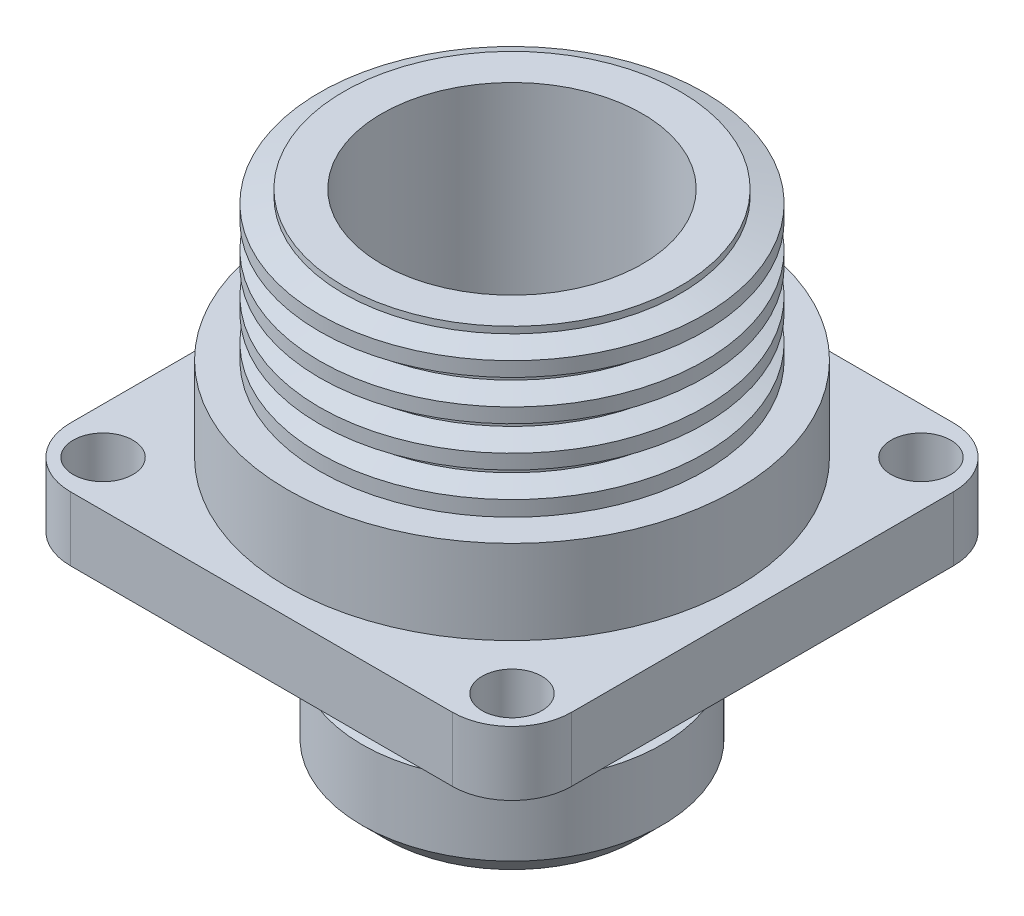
ISO-10303-21;
HEADER;
FILE_DESCRIPTION(('STEP AP214'),'2;1');
FILE_NAME('part.step','',(''),(''),'','','');
FILE_SCHEMA(('AUTOMOTIVE_DESIGN { 1 0 10303 214 1 1 1 1 }'));
ENDSEC;
DATA;
#1=APPLICATION_CONTEXT('core data for automotive mechanical design processes');
#2=APPLICATION_PROTOCOL_DEFINITION('international standard','automotive_design',2000,#1);
#3=PRODUCT_CONTEXT('',#1,'mechanical');
#4=PRODUCT('Part','Part','',(#3));
#5=PRODUCT_RELATED_PRODUCT_CATEGORY('part','',(#4));
#6=PRODUCT_DEFINITION_FORMATION('','',#4);
#7=PRODUCT_DEFINITION_CONTEXT('part definition',#1,'design');
#8=PRODUCT_DEFINITION('design','',#6,#7);
#9=PRODUCT_DEFINITION_SHAPE('','',#8);
#10=(LENGTH_UNIT() NAMED_UNIT(*) SI_UNIT(.MILLI.,.METRE.));
#11=(NAMED_UNIT(*) PLANE_ANGLE_UNIT() SI_UNIT($,.RADIAN.));
#12=(NAMED_UNIT(*) SI_UNIT($,.STERADIAN.) SOLID_ANGLE_UNIT());
#13=UNCERTAINTY_MEASURE_WITH_UNIT(LENGTH_MEASURE(1.E-05),#10,'distance_accuracy_value','');
#14=(GEOMETRIC_REPRESENTATION_CONTEXT(3) GLOBAL_UNCERTAINTY_ASSIGNED_CONTEXT((#13)) GLOBAL_UNIT_ASSIGNED_CONTEXT((#10,
#11,#12)) REPRESENTATION_CONTEXT('',''));
#15=CARTESIAN_POINT('',(0.,0.,0.));
#16=DIRECTION('',(0.,0.,1.));
#17=DIRECTION('',(1.,0.,0.));
#18=AXIS2_PLACEMENT_3D('',#15,#16,#17);
#19=CARTESIAN_POINT('',(0.,18.796,0.));
#20=DIRECTION('',(0.,-1.,0.));
#21=DIRECTION('',(0.,0.,-1.));
#22=AXIS2_PLACEMENT_3D('',#19,#20,#21);
#23=CYLINDRICAL_SURFACE('',#22,12.192);
#24=CARTESIAN_POINT('',(0.,10.3669138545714,0.));
#25=DIRECTION('',(0.,-1.,0.));
#26=DIRECTION('',(0.,0.,-1.));
#27=AXIS2_PLACEMENT_3D('',#24,#25,#26);
#28=CIRCLE('',#27,12.1920000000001);
#29=CARTESIAN_POINT('',(0.,10.3669138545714,-12.1920000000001));
#30=VERTEX_POINT('',#29);
#31=EDGE_CURVE('E536',#30,#30,#28,.T.);
#32=ORIENTED_EDGE('',*,*,#31,.T.);
#33=EDGE_LOOP('',(#32));
#34=FACE_BOUND('',#33,.T.);
#35=CARTESIAN_POINT('',(0.,9.398,0.));
#36=DIRECTION('',(0.,1.,0.));
#37=DIRECTION('',(0.,0.,1.));
#38=AXIS2_PLACEMENT_3D('',#35,#36,#37);
#39=CIRCLE('',#38,12.192);
#40=CARTESIAN_POINT('',(0.,9.398,12.192));
#41=VERTEX_POINT('',#40);
#42=EDGE_CURVE('E541',#41,#41,#39,.T.);
#43=ORIENTED_EDGE('',*,*,#42,.T.);
#44=EDGE_LOOP('',(#43));
#45=FACE_BOUND('',#44,.T.);
#46=ADVANCED_FACE('F258',(#34,#45),#23,.T.);
#47=CARTESIAN_POINT('',(0.,9.398,0.));
#48=DIRECTION('',(0.,1.,0.));
#49=DIRECTION('',(0.,0.,1.));
#50=AXIS2_PLACEMENT_3D('',#47,#48,#49);
#51=PLANE('',#50);
#52=CARTESIAN_POINT('',(0.,9.398,0.));
#53=DIRECTION('',(0.,1.,0.));
#54=DIRECTION('',(0.,0.,1.));
#55=AXIS2_PLACEMENT_3D('',#52,#53,#54);
#56=CIRCLE('',#55,14.224);
#57=CARTESIAN_POINT('',(0.,9.398,14.224));
#58=VERTEX_POINT('',#57);
#59=EDGE_CURVE('E545',#58,#58,#56,.T.);
#60=ORIENTED_EDGE('',*,*,#59,.T.);
#61=EDGE_LOOP('',(#60));
#62=FACE_BOUND('',#61,.T.);
#63=ORIENTED_EDGE('',*,*,#42,.F.);
#64=EDGE_LOOP('',(#63));
#65=FACE_BOUND('',#64,.T.);
#66=ADVANCED_FACE('F456',(#62,#65),#51,.T.);
#67=CARTESIAN_POINT('',(-15.875,4.064,15.875));
#68=DIRECTION('',(0.,1.,0.));
#69=DIRECTION('',(0.,0.,1.));
#70=AXIS2_PLACEMENT_3D('',#67,#68,#69);
#71=PLANE('',#70);
#72=CARTESIAN_POINT('',(-12.954,4.064,12.954));
#73=DIRECTION('',(0.,1.,0.));
#74=DIRECTION('',(0.,0.,-1.));
#75=AXIS2_PLACEMENT_3D('',#72,#73,#74);
#76=CIRCLE('',#75,1.8923);
#77=CARTESIAN_POINT('',(-12.954,4.064,11.0617));
#78=VERTEX_POINT('',#77);
#79=EDGE_CURVE('E401',#78,#78,#76,.T.);
#80=ORIENTED_EDGE('',*,*,#79,.F.);
#81=EDGE_LOOP('',(#80));
#82=FACE_BOUND('',#81,.T.);
#83=CARTESIAN_POINT('',(12.954,4.064,-12.954));
#84=DIRECTION('',(0.,1.,0.));
#85=DIRECTION('',(0.,0.,-1.));
#86=AXIS2_PLACEMENT_3D('',#83,#84,#85);
#87=CIRCLE('',#86,1.8923);
#88=CARTESIAN_POINT('',(12.954,4.064,-14.8463));
#89=VERTEX_POINT('',#88);
#90=EDGE_CURVE('E416',#89,#89,#87,.T.);
#91=ORIENTED_EDGE('',*,*,#90,.F.);
#92=EDGE_LOOP('',(#91));
#93=FACE_BOUND('',#92,.T.);
#94=DIRECTION('',(0.,0.,-1.));
#95=VECTOR('',#94,1.);
#96=CARTESIAN_POINT('',(15.875,4.064,-15.875));
#97=LINE('',#96,#95);
#98=CARTESIAN_POINT('',(15.875,4.064,12.0904));
#99=VERTEX_POINT('',#98);
#100=CARTESIAN_POINT('',(15.875,4.064,-12.0904));
#101=VERTEX_POINT('',#100);
#102=EDGE_CURVE('E429',#99,#101,#97,.T.);
#103=ORIENTED_EDGE('',*,*,#102,.T.);
#104=CARTESIAN_POINT('',(12.0904,4.064,-12.0904));
#105=DIRECTION('',(0.,1.,0.));
#106=DIRECTION('',(0.,0.,1.));
#107=AXIS2_PLACEMENT_3D('',#104,#105,#106);
#108=CIRCLE('',#107,3.7846);
#109=CARTESIAN_POINT('',(12.0904,4.064,-15.875));
#110=VERTEX_POINT('',#109);
#111=EDGE_CURVE('E384',#101,#110,#108,.T.);
#112=ORIENTED_EDGE('',*,*,#111,.T.);
#113=DIRECTION('',(-1.,0.,0.));
#114=VECTOR('',#113,1.);
#115=CARTESIAN_POINT('',(-15.875,4.064,-15.875));
#116=LINE('',#115,#114);
#117=CARTESIAN_POINT('',(-12.0904,4.064,-15.875));
#118=VERTEX_POINT('',#117);
#119=EDGE_CURVE('E346',#110,#118,#116,.T.);
#120=ORIENTED_EDGE('',*,*,#119,.T.);
#121=CARTESIAN_POINT('',(-12.0904,4.064,-12.0904));
#122=DIRECTION('',(0.,1.,0.));
#123=DIRECTION('',(0.,0.,1.));
#124=AXIS2_PLACEMENT_3D('',#121,#122,#123);
#125=CIRCLE('',#124,3.7846);
#126=CARTESIAN_POINT('',(-15.875,4.064,-12.0904));
#127=VERTEX_POINT('',#126);
#128=EDGE_CURVE('E382',#118,#127,#125,.T.);
#129=ORIENTED_EDGE('',*,*,#128,.T.);
#130=DIRECTION('',(0.,0.,1.));
#131=VECTOR('',#130,1.);
#132=CARTESIAN_POINT('',(-15.875,4.064,-15.875));
#133=LINE('',#132,#131);
#134=CARTESIAN_POINT('',(-15.875,4.064,12.0904));
#135=VERTEX_POINT('',#134);
#136=EDGE_CURVE('E353',#127,#135,#133,.T.);
#137=ORIENTED_EDGE('',*,*,#136,.T.);
#138=CARTESIAN_POINT('',(-12.0904,4.064,12.0904));
#139=DIRECTION('',(0.,1.,0.));
#140=DIRECTION('',(0.,0.,1.));
#141=AXIS2_PLACEMENT_3D('',#138,#139,#140);
#142=CIRCLE('',#141,3.7846);
#143=CARTESIAN_POINT('',(-12.0904,4.064,15.875));
#144=VERTEX_POINT('',#143);
#145=EDGE_CURVE('E281',#135,#144,#142,.T.);
#146=ORIENTED_EDGE('',*,*,#145,.T.);
#147=DIRECTION('',(1.,0.,0.));
#148=VECTOR('',#147,1.);
#149=CARTESIAN_POINT('',(-15.875,4.064,15.875));
#150=LINE('',#149,#148);
#151=CARTESIAN_POINT('',(12.0904,4.064,15.875));
#152=VERTEX_POINT('',#151);
#153=EDGE_CURVE('E356',#144,#152,#150,.T.);
#154=ORIENTED_EDGE('',*,*,#153,.T.);
#155=CARTESIAN_POINT('',(12.0904,4.064,12.0904));
#156=DIRECTION('',(0.,1.,0.));
#157=DIRECTION('',(0.,0.,1.));
#158=AXIS2_PLACEMENT_3D('',#155,#156,#157);
#159=CIRCLE('',#158,3.7846);
#160=EDGE_CURVE('E379',#152,#99,#159,.T.);
#161=ORIENTED_EDGE('',*,*,#160,.T.);
#162=EDGE_LOOP('',(#103,#112,#120,#129,#137,#146,#154,#161));
#163=FACE_BOUND('',#162,.T.);
#164=CARTESIAN_POINT('',(-12.954,4.064,-12.954));
#165=DIRECTION('',(0.,1.,0.));
#166=DIRECTION('',(0.,0.,1.));
#167=AXIS2_PLACEMENT_3D('',#164,#165,#166);
#168=CIRCLE('',#167,1.8923);
#169=CARTESIAN_POINT('',(-12.954,4.064,-11.0617));
#170=VERTEX_POINT('',#169);
#171=EDGE_CURVE('E422',#170,#170,#168,.T.);
#172=ORIENTED_EDGE('',*,*,#171,.F.);
#173=EDGE_LOOP('',(#172));
#174=FACE_BOUND('',#173,.T.);
#175=CARTESIAN_POINT('',(12.954,4.064,12.954));
#176=DIRECTION('',(0.,1.,0.));
#177=DIRECTION('',(0.,0.,1.));
#178=AXIS2_PLACEMENT_3D('',#175,#176,#177);
#179=CIRCLE('',#178,1.8923);
#180=CARTESIAN_POINT('',(12.954,4.064,14.8463));
#181=VERTEX_POINT('',#180);
#182=EDGE_CURVE('E410',#181,#181,#179,.T.);
#183=ORIENTED_EDGE('',*,*,#182,.F.);
#184=EDGE_LOOP('',(#183));
#185=FACE_BOUND('',#184,.T.);
#186=CARTESIAN_POINT('',(0.,4.064,0.));
#187=DIRECTION('',(0.,1.,0.));
#188=DIRECTION('',(0.,0.,1.));
#189=AXIS2_PLACEMENT_3D('',#186,#187,#188);
#190=CIRCLE('',#189,14.224);
#191=CARTESIAN_POINT('',(0.,4.064,14.224));
#192=VERTEX_POINT('',#191);
#193=EDGE_CURVE('E544',#192,#192,#190,.T.);
#194=ORIENTED_EDGE('',*,*,#193,.F.);
#195=EDGE_LOOP('',(#194));
#196=FACE_BOUND('',#195,.T.);
#197=ADVANCED_FACE('F441',(#82,#93,#163,#174,#185,#196),#71,.T.);
#198=CARTESIAN_POINT('',(-15.875,0.,15.875));
#199=DIRECTION('',(0.,1.,0.));
#200=DIRECTION('',(0.,0.,1.));
#201=AXIS2_PLACEMENT_3D('',#198,#199,#200);
#202=PLANE('',#201);
#203=CARTESIAN_POINT('',(0.,0.,0.));
#204=DIRECTION('',(0.,1.,0.));
#205=DIRECTION('',(0.,0.,1.));
#206=AXIS2_PLACEMENT_3D('',#203,#204,#205);
#207=CIRCLE('',#206,13.0505245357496);
#208=CARTESIAN_POINT('',(0.,0.,13.0505245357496));
#209=VERTEX_POINT('',#208);
#210=EDGE_CURVE('E748',#209,#209,#207,.T.);
#211=ORIENTED_EDGE('',*,*,#210,.T.);
#212=EDGE_LOOP('',(#211));
#213=FACE_BOUND('',#212,.T.);
#214=CARTESIAN_POINT('',(12.954,0.,12.954));
#215=DIRECTION('',(0.,1.,0.));
#216=DIRECTION('',(0.,0.,1.));
#217=AXIS2_PLACEMENT_3D('',#214,#215,#216);
#218=CIRCLE('',#217,1.8923);
#219=CARTESIAN_POINT('',(12.954,0.,14.8463));
#220=VERTEX_POINT('',#219);
#221=EDGE_CURVE('E406',#220,#220,#218,.T.);
#222=ORIENTED_EDGE('',*,*,#221,.T.);
#223=EDGE_LOOP('',(#222));
#224=FACE_BOUND('',#223,.T.);
#225=CARTESIAN_POINT('',(-12.954,0.,-12.954));
#226=DIRECTION('',(0.,1.,0.));
#227=DIRECTION('',(0.,0.,1.));
#228=AXIS2_PLACEMENT_3D('',#225,#226,#227);
#229=CIRCLE('',#228,1.8923);
#230=CARTESIAN_POINT('',(-12.954,0.,-11.0617));
#231=VERTEX_POINT('',#230);
#232=EDGE_CURVE('E419',#231,#231,#229,.T.);
#233=ORIENTED_EDGE('',*,*,#232,.T.);
#234=EDGE_LOOP('',(#233));
#235=FACE_BOUND('',#234,.T.);
#236=DIRECTION('',(-1.,0.,0.));
#237=VECTOR('',#236,1.);
#238=CARTESIAN_POINT('',(-15.875,0.,-15.875));
#239=LINE('',#238,#237);
#240=CARTESIAN_POINT('',(12.0904,0.,-15.875));
#241=VERTEX_POINT('',#240);
#242=CARTESIAN_POINT('',(-12.0904,0.,-15.875));
#243=VERTEX_POINT('',#242);
#244=EDGE_CURVE('E343',#241,#243,#239,.T.);
#245=ORIENTED_EDGE('',*,*,#244,.F.);
#246=CARTESIAN_POINT('',(12.0904,0.,-12.0904));
#247=DIRECTION('',(0.,1.,0.));
#248=DIRECTION('',(0.,0.,1.));
#249=AXIS2_PLACEMENT_3D('',#246,#247,#248);
#250=CIRCLE('',#249,3.7846);
#251=CARTESIAN_POINT('',(15.875,0.,-12.0904));
#252=VERTEX_POINT('',#251);
#253=EDGE_CURVE('E326',#241,#252,#250,.F.);
#254=ORIENTED_EDGE('',*,*,#253,.T.);
#255=DIRECTION('',(0.,0.,-1.));
#256=VECTOR('',#255,1.);
#257=CARTESIAN_POINT('',(15.875,0.,-15.875));
#258=LINE('',#257,#256);
#259=CARTESIAN_POINT('',(15.875,0.,12.0904));
#260=VERTEX_POINT('',#259);
#261=EDGE_CURVE('E354',#260,#252,#258,.T.);
#262=ORIENTED_EDGE('',*,*,#261,.F.);
#263=CARTESIAN_POINT('',(12.0904,0.,12.0904));
#264=DIRECTION('',(0.,1.,0.));
#265=DIRECTION('',(0.,0.,1.));
#266=AXIS2_PLACEMENT_3D('',#263,#264,#265);
#267=CIRCLE('',#266,3.7846);
#268=CARTESIAN_POINT('',(12.0904,0.,15.875));
#269=VERTEX_POINT('',#268);
#270=EDGE_CURVE('E347',#260,#269,#267,.F.);
#271=ORIENTED_EDGE('',*,*,#270,.T.);
#272=DIRECTION('',(1.,0.,0.));
#273=VECTOR('',#272,1.);
#274=CARTESIAN_POINT('',(-15.875,0.,15.875));
#275=LINE('',#274,#273);
#276=CARTESIAN_POINT('',(-12.0904,0.,15.875));
#277=VERTEX_POINT('',#276);
#278=EDGE_CURVE('E358',#277,#269,#275,.T.);
#279=ORIENTED_EDGE('',*,*,#278,.F.);
#280=CARTESIAN_POINT('',(-12.0904,0.,12.0904));
#281=DIRECTION('',(0.,1.,0.));
#282=DIRECTION('',(0.,0.,1.));
#283=AXIS2_PLACEMENT_3D('',#280,#281,#282);
#284=CIRCLE('',#283,3.7846);
#285=CARTESIAN_POINT('',(-15.875,0.,12.0904));
#286=VERTEX_POINT('',#285);
#287=EDGE_CURVE('E373',#277,#286,#284,.F.);
#288=ORIENTED_EDGE('',*,*,#287,.T.);
#289=DIRECTION('',(0.,0.,1.));
#290=VECTOR('',#289,1.);
#291=CARTESIAN_POINT('',(-15.875,0.,-15.875));
#292=LINE('',#291,#290);
#293=CARTESIAN_POINT('',(-15.875,0.,-12.0904));
#294=VERTEX_POINT('',#293);
#295=EDGE_CURVE('E425',#294,#286,#292,.T.);
#296=ORIENTED_EDGE('',*,*,#295,.F.);
#297=CARTESIAN_POINT('',(-12.0904,0.,-12.0904));
#298=DIRECTION('',(0.,1.,0.));
#299=DIRECTION('',(0.,0.,1.));
#300=AXIS2_PLACEMENT_3D('',#297,#298,#299);
#301=CIRCLE('',#300,3.7846);
#302=EDGE_CURVE('E337',#294,#243,#301,.F.);
#303=ORIENTED_EDGE('',*,*,#302,.T.);
#304=EDGE_LOOP('',(#245,#254,#262,#271,#279,#288,#296,#303));
#305=FACE_BOUND('',#304,.T.);
#306=CARTESIAN_POINT('',(12.954,0.,-12.954));
#307=DIRECTION('',(0.,1.,0.));
#308=DIRECTION('',(0.,0.,-1.));
#309=AXIS2_PLACEMENT_3D('',#306,#307,#308);
#310=CIRCLE('',#309,1.8923);
#311=CARTESIAN_POINT('',(12.954,0.,-14.8463));
#312=VERTEX_POINT('',#311);
#313=EDGE_CURVE('E413',#312,#312,#310,.T.);
#314=ORIENTED_EDGE('',*,*,#313,.T.);
#315=EDGE_LOOP('',(#314));
#316=FACE_BOUND('',#315,.T.);
#317=CARTESIAN_POINT('',(-12.954,0.,12.954));
#318=DIRECTION('',(0.,1.,0.));
#319=DIRECTION('',(0.,0.,-1.));
#320=AXIS2_PLACEMENT_3D('',#317,#318,#319);
#321=CIRCLE('',#320,1.8923);
#322=CARTESIAN_POINT('',(-12.954,0.,11.0617));
#323=VERTEX_POINT('',#322);
#324=EDGE_CURVE('E397',#323,#323,#321,.T.);
#325=ORIENTED_EDGE('',*,*,#324,.T.);
#326=EDGE_LOOP('',(#325));
#327=FACE_BOUND('',#326,.T.);
#328=ADVANCED_FACE('F350',(#213,#224,#235,#305,#316,#327),#202,.F.);
#329=CARTESIAN_POINT('',(-15.875,4.064,-15.875));
#330=DIRECTION('',(1.,0.,0.));
#331=DIRECTION('',(0.,0.,-1.));
#332=AXIS2_PLACEMENT_3D('',#329,#330,#331);
#333=PLANE('',#332);
#334=ORIENTED_EDGE('',*,*,#136,.F.);
#335=DIRECTION('',(0.,-1.,0.));
#336=VECTOR('',#335,1.);
#337=CARTESIAN_POINT('',(-15.875,4.064,-12.0904));
#338=LINE('',#337,#336);
#339=EDGE_CURVE('E388',#127,#294,#338,.T.);
#340=ORIENTED_EDGE('',*,*,#339,.T.);
#341=ORIENTED_EDGE('',*,*,#295,.T.);
#342=DIRECTION('',(0.,-1.,0.));
#343=VECTOR('',#342,1.);
#344=CARTESIAN_POINT('',(-15.875,4.064,12.0904));
#345=LINE('',#344,#343);
#346=EDGE_CURVE('E386',#286,#135,#345,.F.);
#347=ORIENTED_EDGE('',*,*,#346,.T.);
#348=EDGE_LOOP('',(#334,#340,#341,#347));
#349=FACE_BOUND('',#348,.T.);
#350=ADVANCED_FACE('F453',(#349),#333,.F.);
#351=CARTESIAN_POINT('',(-15.875,4.064,15.875));
#352=DIRECTION('',(0.,0.,-1.));
#353=DIRECTION('',(-1.,0.,0.));
#354=AXIS2_PLACEMENT_3D('',#351,#352,#353);
#355=PLANE('',#354);
#356=ORIENTED_EDGE('',*,*,#153,.F.);
#357=DIRECTION('',(0.,-1.,0.));
#358=VECTOR('',#357,1.);
#359=CARTESIAN_POINT('',(-12.0904,4.064,15.875));
#360=LINE('',#359,#358);
#361=EDGE_CURVE('E12',#144,#277,#360,.T.);
#362=ORIENTED_EDGE('',*,*,#361,.T.);
#363=ORIENTED_EDGE('',*,*,#278,.T.);
#364=DIRECTION('',(0.,-1.,0.));
#365=VECTOR('',#364,1.);
#366=CARTESIAN_POINT('',(12.0904,4.064,15.875));
#367=LINE('',#366,#365);
#368=EDGE_CURVE('E267',#269,#152,#367,.F.);
#369=ORIENTED_EDGE('',*,*,#368,.T.);
#370=EDGE_LOOP('',(#356,#362,#363,#369));
#371=FACE_BOUND('',#370,.T.);
#372=ADVANCED_FACE('F435',(#371),#355,.F.);
#373=CARTESIAN_POINT('',(15.875,4.064,-15.875));
#374=DIRECTION('',(-1.,0.,0.));
#375=DIRECTION('',(0.,0.,1.));
#376=AXIS2_PLACEMENT_3D('',#373,#374,#375);
#377=PLANE('',#376);
#378=ORIENTED_EDGE('',*,*,#261,.T.);
#379=DIRECTION('',(0.,-1.,0.));
#380=VECTOR('',#379,1.);
#381=CARTESIAN_POINT('',(15.875,4.064,-12.0904));
#382=LINE('',#381,#380);
#383=EDGE_CURVE('E331',#252,#101,#382,.F.);
#384=ORIENTED_EDGE('',*,*,#383,.T.);
#385=ORIENTED_EDGE('',*,*,#102,.F.);
#386=DIRECTION('',(0.,-1.,0.));
#387=VECTOR('',#386,1.);
#388=CARTESIAN_POINT('',(15.875,4.064,12.0904));
#389=LINE('',#388,#387);
#390=EDGE_CURVE('E336',#99,#260,#389,.T.);
#391=ORIENTED_EDGE('',*,*,#390,.T.);
#392=EDGE_LOOP('',(#378,#384,#385,#391));
#393=FACE_BOUND('',#392,.T.);
#394=ADVANCED_FACE('F444',(#393),#377,.F.);
#395=CARTESIAN_POINT('',(-15.875,4.064,-15.875));
#396=DIRECTION('',(0.,0.,1.));
#397=DIRECTION('',(1.,0.,0.));
#398=AXIS2_PLACEMENT_3D('',#395,#396,#397);
#399=PLANE('',#398);
#400=ORIENTED_EDGE('',*,*,#119,.F.);
#401=DIRECTION('',(0.,-1.,0.));
#402=VECTOR('',#401,1.);
#403=CARTESIAN_POINT('',(12.0904,4.064,-15.875));
#404=LINE('',#403,#402);
#405=EDGE_CURVE('E330',#110,#241,#404,.T.);
#406=ORIENTED_EDGE('',*,*,#405,.T.);
#407=ORIENTED_EDGE('',*,*,#244,.T.);
#408=DIRECTION('',(0.,-1.,0.));
#409=VECTOR('',#408,1.);
#410=CARTESIAN_POINT('',(-12.0904,4.064,-15.875));
#411=LINE('',#410,#409);
#412=EDGE_CURVE('E348',#243,#118,#411,.F.);
#413=ORIENTED_EDGE('',*,*,#412,.T.);
#414=EDGE_LOOP('',(#400,#406,#407,#413));
#415=FACE_BOUND('',#414,.T.);
#416=ADVANCED_FACE('F342',(#415),#399,.F.);
#417=CARTESIAN_POINT('',(-12.954,4.064,-12.954));
#418=DIRECTION('',(0.,-1.,0.));
#419=DIRECTION('',(0.,0.,-1.));
#420=AXIS2_PLACEMENT_3D('',#417,#418,#419);
#421=CYLINDRICAL_SURFACE('',#420,1.8923);
#422=ORIENTED_EDGE('',*,*,#171,.T.);
#423=EDGE_LOOP('',(#422));
#424=FACE_BOUND('',#423,.T.);
#425=ORIENTED_EDGE('',*,*,#232,.F.);
#426=EDGE_LOOP('',(#425));
#427=FACE_BOUND('',#426,.T.);
#428=ADVANCED_FACE('F451',(#424,#427),#421,.F.);
#429=CARTESIAN_POINT('',(12.954,4.064,-12.954));
#430=DIRECTION('',(0.,-1.,0.));
#431=DIRECTION('',(0.,0.,-1.));
#432=AXIS2_PLACEMENT_3D('',#429,#430,#431);
#433=CYLINDRICAL_SURFACE('',#432,1.8923);
#434=ORIENTED_EDGE('',*,*,#90,.T.);
#435=EDGE_LOOP('',(#434));
#436=FACE_BOUND('',#435,.T.);
#437=ORIENTED_EDGE('',*,*,#313,.F.);
#438=EDGE_LOOP('',(#437));
#439=FACE_BOUND('',#438,.T.);
#440=ADVANCED_FACE('F597',(#436,#439),#433,.F.);
#441=CARTESIAN_POINT('',(12.954,4.064,12.954));
#442=DIRECTION('',(0.,-1.,0.));
#443=DIRECTION('',(0.,0.,-1.));
#444=AXIS2_PLACEMENT_3D('',#441,#442,#443);
#445=CYLINDRICAL_SURFACE('',#444,1.8923);
#446=ORIENTED_EDGE('',*,*,#182,.T.);
#447=EDGE_LOOP('',(#446));
#448=FACE_BOUND('',#447,.T.);
#449=ORIENTED_EDGE('',*,*,#221,.F.);
#450=EDGE_LOOP('',(#449));
#451=FACE_BOUND('',#450,.T.);
#452=ADVANCED_FACE('F593',(#448,#451),#445,.F.);
#453=CARTESIAN_POINT('',(-12.954,4.064,12.954));
#454=DIRECTION('',(0.,-1.,0.));
#455=DIRECTION('',(0.,0.,-1.));
#456=AXIS2_PLACEMENT_3D('',#453,#454,#455);
#457=CYLINDRICAL_SURFACE('',#456,1.8923);
#458=ORIENTED_EDGE('',*,*,#79,.T.);
#459=EDGE_LOOP('',(#458));
#460=FACE_BOUND('',#459,.T.);
#461=ORIENTED_EDGE('',*,*,#324,.F.);
#462=EDGE_LOOP('',(#461));
#463=FACE_BOUND('',#462,.T.);
#464=ADVANCED_FACE('F590',(#460,#463),#457,.F.);
#465=CARTESIAN_POINT('',(12.0904,4.064,-12.0904));
#466=DIRECTION('',(0.,-1.,0.));
#467=DIRECTION('',(0.,0.,-1.));
#468=AXIS2_PLACEMENT_3D('',#465,#466,#467);
#469=CYLINDRICAL_SURFACE('',#468,3.7846);
#470=ORIENTED_EDGE('',*,*,#111,.F.);
#471=ORIENTED_EDGE('',*,*,#383,.F.);
#472=ORIENTED_EDGE('',*,*,#253,.F.);
#473=ORIENTED_EDGE('',*,*,#405,.F.);
#474=EDGE_LOOP('',(#470,#471,#472,#473));
#475=FACE_BOUND('',#474,.T.);
#476=ADVANCED_FACE('F329',(#475),#469,.T.);
#477=CARTESIAN_POINT('',(-12.0904,4.064,-12.0904));
#478=DIRECTION('',(0.,-1.,0.));
#479=DIRECTION('',(0.,0.,-1.));
#480=AXIS2_PLACEMENT_3D('',#477,#478,#479);
#481=CYLINDRICAL_SURFACE('',#480,3.7846);
#482=ORIENTED_EDGE('',*,*,#128,.F.);
#483=ORIENTED_EDGE('',*,*,#412,.F.);
#484=ORIENTED_EDGE('',*,*,#302,.F.);
#485=ORIENTED_EDGE('',*,*,#339,.F.);
#486=EDGE_LOOP('',(#482,#483,#484,#485));
#487=FACE_BOUND('',#486,.T.);
#488=ADVANCED_FACE('F999',(#487),#481,.T.);
#489=CARTESIAN_POINT('',(-12.0904,4.064,12.0904));
#490=DIRECTION('',(0.,-1.,0.));
#491=DIRECTION('',(0.,0.,-1.));
#492=AXIS2_PLACEMENT_3D('',#489,#490,#491);
#493=CYLINDRICAL_SURFACE('',#492,3.7846);
#494=ORIENTED_EDGE('',*,*,#145,.F.);
#495=ORIENTED_EDGE('',*,*,#346,.F.);
#496=ORIENTED_EDGE('',*,*,#287,.F.);
#497=ORIENTED_EDGE('',*,*,#361,.F.);
#498=EDGE_LOOP('',(#494,#495,#496,#497));
#499=FACE_BOUND('',#498,.T.);
#500=ADVANCED_FACE('F1008',(#499),#493,.T.);
#501=CARTESIAN_POINT('',(12.0904,4.064,12.0904));
#502=DIRECTION('',(0.,-1.,0.));
#503=DIRECTION('',(0.,0.,-1.));
#504=AXIS2_PLACEMENT_3D('',#501,#502,#503);
#505=CYLINDRICAL_SURFACE('',#504,3.7846);
#506=ORIENTED_EDGE('',*,*,#160,.F.);
#507=ORIENTED_EDGE('',*,*,#368,.F.);
#508=ORIENTED_EDGE('',*,*,#270,.F.);
#509=ORIENTED_EDGE('',*,*,#390,.F.);
#510=EDGE_LOOP('',(#506,#507,#508,#509));
#511=FACE_BOUND('',#510,.T.);
#512=ADVANCED_FACE('F260',(#511),#505,.T.);
#513=CARTESIAN_POINT('',(0.,9.398,0.));
#514=DIRECTION('',(0.,-1.,0.));
#515=DIRECTION('',(0.,0.,-1.));
#516=AXIS2_PLACEMENT_3D('',#513,#514,#515);
#517=CYLINDRICAL_SURFACE('',#516,14.224);
#518=ORIENTED_EDGE('',*,*,#59,.F.);
#519=EDGE_LOOP('',(#518));
#520=FACE_BOUND('',#519,.T.);
#521=ORIENTED_EDGE('',*,*,#193,.T.);
#522=EDGE_LOOP('',(#521));
#523=FACE_BOUND('',#522,.T.);
#524=ADVANCED_FACE('F679',(#520,#523),#517,.T.);
#525=CARTESIAN_POINT('',(0.,10.7610470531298,0.));
#526=DIRECTION('',(0.,-1.,0.));
#527=DIRECTION('',(0.,0.,-1.));
#528=AXIS2_PLACEMENT_3D('',#525,#526,#527);
#529=CONICAL_SURFACE('',#528,10.6680000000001,1.31772358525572);
#530=ORIENTED_EDGE('',*,*,#31,.F.);
#531=EDGE_LOOP('',(#530));
#532=FACE_BOUND('',#531,.T.);
#533=CARTESIAN_POINT('',(0.,10.7610470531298,0.));
#534=DIRECTION('',(0.,-1.,0.));
#535=DIRECTION('',(0.,0.,-1.));
#536=AXIS2_PLACEMENT_3D('',#533,#534,#535);
#537=CIRCLE('',#536,10.6680000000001);
#538=CARTESIAN_POINT('',(0.,10.7610470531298,-10.6680000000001));
#539=VERTEX_POINT('',#538);
#540=EDGE_CURVE('E533',#539,#539,#537,.T.);
#541=ORIENTED_EDGE('',*,*,#540,.T.);
#542=EDGE_LOOP('',(#541));
#543=FACE_BOUND('',#542,.T.);
#544=ADVANCED_FACE('F676',(#532,#543),#529,.T.);
#545=CARTESIAN_POINT('',(0.,0.,0.));
#546=DIRECTION('',(0.,-1.,0.));
#547=DIRECTION('',(0.,0.,-1.));
#548=AXIS2_PLACEMENT_3D('',#545,#546,#547);
#549=CYLINDRICAL_SURFACE('',#548,10.6680000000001);
#550=ORIENTED_EDGE('',*,*,#540,.F.);
#551=EDGE_LOOP('',(#550));
#552=FACE_BOUND('',#551,.T.);
#553=CARTESIAN_POINT('',(0.,11.5909529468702,0.));
#554=DIRECTION('',(0.,-1.,0.));
#555=DIRECTION('',(0.,0.,-1.));
#556=AXIS2_PLACEMENT_3D('',#553,#554,#555);
#557=CIRCLE('',#556,10.6680000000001);
#558=CARTESIAN_POINT('',(0.,11.5909529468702,-10.6680000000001));
#559=VERTEX_POINT('',#558);
#560=EDGE_CURVE('E530',#559,#559,#557,.T.);
#561=ORIENTED_EDGE('',*,*,#560,.T.);
#562=EDGE_LOOP('',(#561));
#563=FACE_BOUND('',#562,.T.);
#564=ADVANCED_FACE('F672',(#552,#563),#549,.T.);
#565=CARTESIAN_POINT('',(0.,11.9850861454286,0.));
#566=DIRECTION('',(0.,1.,0.));
#567=DIRECTION('',(0.,0.,1.));
#568=AXIS2_PLACEMENT_3D('',#565,#566,#567);
#569=CONICAL_SURFACE('',#568,12.1920000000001,1.31772358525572);
#570=ORIENTED_EDGE('',*,*,#560,.F.);
#571=EDGE_LOOP('',(#570));
#572=FACE_BOUND('',#571,.T.);
#573=CARTESIAN_POINT('',(0.,11.9850861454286,0.));
#574=DIRECTION('',(0.,-1.,0.));
#575=DIRECTION('',(0.,0.,-1.));
#576=AXIS2_PLACEMENT_3D('',#573,#574,#575);
#577=CIRCLE('',#576,12.1920000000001);
#578=CARTESIAN_POINT('',(0.,11.9850861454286,-12.1920000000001));
#579=VERTEX_POINT('',#578);
#580=EDGE_CURVE('E527',#579,#579,#577,.T.);
#581=ORIENTED_EDGE('',*,*,#580,.T.);
#582=EDGE_LOOP('',(#581));
#583=FACE_BOUND('',#582,.T.);
#584=ADVANCED_FACE('F471',(#572,#583),#569,.T.);
#585=ORIENTED_EDGE('',*,*,#580,.F.);
#586=EDGE_LOOP('',(#585));
#587=FACE_BOUND('',#586,.T.);
#588=CARTESIAN_POINT('',(0.,12.9069138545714,0.));
#589=DIRECTION('',(0.,-1.,0.));
#590=DIRECTION('',(0.,0.,-1.));
#591=AXIS2_PLACEMENT_3D('',#588,#589,#590);
#592=CIRCLE('',#591,12.1920000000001);
#593=CARTESIAN_POINT('',(0.,12.9069138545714,-12.1920000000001));
#594=VERTEX_POINT('',#593);
#595=EDGE_CURVE('E524',#594,#594,#592,.T.);
#596=ORIENTED_EDGE('',*,*,#595,.T.);
#597=EDGE_LOOP('',(#596));
#598=FACE_BOUND('',#597,.T.);
#599=ADVANCED_FACE('F459',(#587,#598),#23,.T.);
#600=CARTESIAN_POINT('',(0.,13.3010470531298,0.));
#601=DIRECTION('',(0.,-1.,0.));
#602=DIRECTION('',(0.,0.,-1.));
#603=AXIS2_PLACEMENT_3D('',#600,#601,#602);
#604=CONICAL_SURFACE('',#603,10.6680000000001,1.31772358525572);
#605=ORIENTED_EDGE('',*,*,#595,.F.);
#606=EDGE_LOOP('',(#605));
#607=FACE_BOUND('',#606,.T.);
#608=CARTESIAN_POINT('',(0.,13.3010470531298,0.));
#609=DIRECTION('',(0.,-1.,0.));
#610=DIRECTION('',(0.,0.,-1.));
#611=AXIS2_PLACEMENT_3D('',#608,#609,#610);
#612=CIRCLE('',#611,10.6680000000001);
#613=CARTESIAN_POINT('',(0.,13.3010470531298,-10.6680000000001));
#614=VERTEX_POINT('',#613);
#615=EDGE_CURVE('E521',#614,#614,#612,.T.);
#616=ORIENTED_EDGE('',*,*,#615,.T.);
#617=EDGE_LOOP('',(#616));
#618=FACE_BOUND('',#617,.T.);
#619=ADVANCED_FACE('F470',(#607,#618),#604,.T.);
#620=CARTESIAN_POINT('',(0.,0.,0.));
#621=DIRECTION('',(0.,-1.,0.));
#622=DIRECTION('',(0.,0.,-1.));
#623=AXIS2_PLACEMENT_3D('',#620,#621,#622);
#624=CYLINDRICAL_SURFACE('',#623,10.6680000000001);
#625=ORIENTED_EDGE('',*,*,#615,.F.);
#626=EDGE_LOOP('',(#625));
#627=FACE_BOUND('',#626,.T.);
#628=CARTESIAN_POINT('',(0.,14.1309529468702,0.));
#629=DIRECTION('',(0.,-1.,0.));
#630=DIRECTION('',(0.,0.,-1.));
#631=AXIS2_PLACEMENT_3D('',#628,#629,#630);
#632=CIRCLE('',#631,10.6680000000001);
#633=CARTESIAN_POINT('',(0.,14.1309529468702,-10.6680000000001));
#634=VERTEX_POINT('',#633);
#635=EDGE_CURVE('E512',#634,#634,#632,.T.);
#636=ORIENTED_EDGE('',*,*,#635,.T.);
#637=EDGE_LOOP('',(#636));
#638=FACE_BOUND('',#637,.T.);
#639=ADVANCED_FACE('F500',(#627,#638),#624,.T.);
#640=CARTESIAN_POINT('',(0.,14.5250861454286,0.));
#641=DIRECTION('',(0.,1.,0.));
#642=DIRECTION('',(0.,0.,1.));
#643=AXIS2_PLACEMENT_3D('',#640,#641,#642);
#644=CONICAL_SURFACE('',#643,12.1920000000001,1.31772358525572);
#645=ORIENTED_EDGE('',*,*,#635,.F.);
#646=EDGE_LOOP('',(#645));
#647=FACE_BOUND('',#646,.T.);
#648=CARTESIAN_POINT('',(0.,14.5250861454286,0.));
#649=DIRECTION('',(0.,-1.,0.));
#650=DIRECTION('',(0.,0.,-1.));
#651=AXIS2_PLACEMENT_3D('',#648,#649,#650);
#652=CIRCLE('',#651,12.1920000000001);
#653=CARTESIAN_POINT('',(0.,14.5250861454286,-12.1920000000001));
#654=VERTEX_POINT('',#653);
#655=EDGE_CURVE('E506',#654,#654,#652,.T.);
#656=ORIENTED_EDGE('',*,*,#655,.T.);
#657=EDGE_LOOP('',(#656));
#658=FACE_BOUND('',#657,.T.);
#659=ADVANCED_FACE('F492',(#647,#658),#644,.T.);
#660=ORIENTED_EDGE('',*,*,#655,.F.);
#661=EDGE_LOOP('',(#660));
#662=FACE_BOUND('',#661,.T.);
#663=CARTESIAN_POINT('',(0.,15.4469138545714,0.));
#664=DIRECTION('',(0.,-1.,0.));
#665=DIRECTION('',(0.,0.,-1.));
#666=AXIS2_PLACEMENT_3D('',#663,#664,#665);
#667=CIRCLE('',#666,12.192);
#668=CARTESIAN_POINT('',(0.,15.4469138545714,-12.192));
#669=VERTEX_POINT('',#668);
#670=EDGE_CURVE('E509',#669,#669,#667,.T.);
#671=ORIENTED_EDGE('',*,*,#670,.T.);
#672=EDGE_LOOP('',(#671));
#673=FACE_BOUND('',#672,.T.);
#674=ADVANCED_FACE('F473',(#662,#673),#23,.T.);
#675=CARTESIAN_POINT('',(0.,15.8410470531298,0.));
#676=DIRECTION('',(0.,-1.,0.));
#677=DIRECTION('',(0.,0.,-1.));
#678=AXIS2_PLACEMENT_3D('',#675,#676,#677);
#679=CONICAL_SURFACE('',#678,10.668,1.31772358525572);
#680=ORIENTED_EDGE('',*,*,#670,.F.);
#681=EDGE_LOOP('',(#680));
#682=FACE_BOUND('',#681,.T.);
#683=CARTESIAN_POINT('',(0.,15.8410470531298,0.));
#684=DIRECTION('',(0.,-1.,0.));
#685=DIRECTION('',(0.,0.,-1.));
#686=AXIS2_PLACEMENT_3D('',#683,#684,#685);
#687=CIRCLE('',#686,10.668);
#688=CARTESIAN_POINT('',(0.,15.8410470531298,-10.668));
#689=VERTEX_POINT('',#688);
#690=EDGE_CURVE('E510',#689,#689,#687,.T.);
#691=ORIENTED_EDGE('',*,*,#690,.T.);
#692=EDGE_LOOP('',(#691));
#693=FACE_BOUND('',#692,.T.);
#694=ADVANCED_FACE('F491',(#682,#693),#679,.T.);
#695=CARTESIAN_POINT('',(0.,0.,0.));
#696=DIRECTION('',(0.,-1.,0.));
#697=DIRECTION('',(0.,0.,-1.));
#698=AXIS2_PLACEMENT_3D('',#695,#696,#697);
#699=CYLINDRICAL_SURFACE('',#698,10.668);
#700=ORIENTED_EDGE('',*,*,#690,.F.);
#701=EDGE_LOOP('',(#700));
#702=FACE_BOUND('',#701,.T.);
#703=CARTESIAN_POINT('',(0.,16.6709529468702,0.));
#704=DIRECTION('',(0.,-1.,0.));
#705=DIRECTION('',(0.,0.,-1.));
#706=AXIS2_PLACEMENT_3D('',#703,#704,#705);
#707=CIRCLE('',#706,10.668);
#708=CARTESIAN_POINT('',(0.,16.6709529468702,-10.668));
#709=VERTEX_POINT('',#708);
#710=EDGE_CURVE('E515',#709,#709,#707,.T.);
#711=ORIENTED_EDGE('',*,*,#710,.T.);
#712=EDGE_LOOP('',(#711));
#713=FACE_BOUND('',#712,.T.);
#714=ADVANCED_FACE('F485',(#702,#713),#699,.T.);
#715=CARTESIAN_POINT('',(0.,17.0650861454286,0.));
#716=DIRECTION('',(0.,1.,0.));
#717=DIRECTION('',(0.,0.,1.));
#718=AXIS2_PLACEMENT_3D('',#715,#716,#717);
#719=CONICAL_SURFACE('',#718,12.192,1.31772358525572);
#720=ORIENTED_EDGE('',*,*,#710,.F.);
#721=EDGE_LOOP('',(#720));
#722=FACE_BOUND('',#721,.T.);
#723=CARTESIAN_POINT('',(0.,17.0650861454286,0.));
#724=DIRECTION('',(0.,-1.,0.));
#725=DIRECTION('',(0.,0.,-1.));
#726=AXIS2_PLACEMENT_3D('',#723,#724,#725);
#727=CIRCLE('',#726,12.192);
#728=CARTESIAN_POINT('',(0.,17.0650861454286,-12.192));
#729=VERTEX_POINT('',#728);
#730=EDGE_CURVE('E649',#729,#729,#727,.T.);
#731=ORIENTED_EDGE('',*,*,#730,.T.);
#732=EDGE_LOOP('',(#731));
#733=FACE_BOUND('',#732,.T.);
#734=ADVANCED_FACE('F476',(#722,#733),#719,.T.);
#735=CARTESIAN_POINT('',(0.,17.9869138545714,0.));
#736=DIRECTION('',(0.,-1.,0.));
#737=DIRECTION('',(0.,0.,-1.));
#738=AXIS2_PLACEMENT_3D('',#735,#736,#737);
#739=CIRCLE('',#738,12.192);
#740=CARTESIAN_POINT('',(0.,17.9869138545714,-12.192));
#741=VERTEX_POINT('',#740);
#742=EDGE_CURVE('E645',#741,#741,#739,.T.);
#743=ORIENTED_EDGE('',*,*,#742,.T.);
#744=EDGE_LOOP('',(#743));
#745=FACE_BOUND('',#744,.T.);
#746=ORIENTED_EDGE('',*,*,#730,.F.);
#747=EDGE_LOOP('',(#746));
#748=FACE_BOUND('',#747,.T.);
#749=ADVANCED_FACE('F460',(#745,#748),#23,.T.);
#750=CARTESIAN_POINT('',(0.,0.,0.));
#751=DIRECTION('',(0.,-1.,0.));
#752=DIRECTION('',(0.,0.,-1.));
#753=AXIS2_PLACEMENT_3D('',#750,#751,#752);
#754=CYLINDRICAL_SURFACE('',#753,10.668);
#755=CARTESIAN_POINT('',(0.,18.796,0.));
#756=DIRECTION('',(0.,1.,0.));
#757=DIRECTION('',(0.,0.,1.));
#758=AXIS2_PLACEMENT_3D('',#755,#756,#757);
#759=CIRCLE('',#758,10.668);
#760=CARTESIAN_POINT('',(0.,18.796,10.668));
#761=VERTEX_POINT('',#760);
#762=EDGE_CURVE('E262',#761,#761,#759,.F.);
#763=ORIENTED_EDGE('',*,*,#762,.T.);
#764=EDGE_LOOP('',(#763));
#765=FACE_BOUND('',#764,.T.);
#766=CARTESIAN_POINT('',(0.,18.3810470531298,0.));
#767=DIRECTION('',(0.,-1.,0.));
#768=DIRECTION('',(0.,0.,-1.));
#769=AXIS2_PLACEMENT_3D('',#766,#767,#768);
#770=CIRCLE('',#769,10.668);
#771=CARTESIAN_POINT('',(0.,18.3810470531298,-10.668));
#772=VERTEX_POINT('',#771);
#773=EDGE_CURVE('E538',#772,#772,#770,.T.);
#774=ORIENTED_EDGE('',*,*,#773,.F.);
#775=EDGE_LOOP('',(#774));
#776=FACE_BOUND('',#775,.T.);
#777=ADVANCED_FACE('F475',(#765,#776),#754,.T.);
#778=CARTESIAN_POINT('',(0.,18.3810470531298,0.));
#779=DIRECTION('',(0.,-1.,0.));
#780=DIRECTION('',(0.,0.,-1.));
#781=AXIS2_PLACEMENT_3D('',#778,#779,#780);
#782=CONICAL_SURFACE('',#781,10.668,1.31772358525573);
#783=ORIENTED_EDGE('',*,*,#742,.F.);
#784=EDGE_LOOP('',(#783));
#785=FACE_BOUND('',#784,.T.);
#786=ORIENTED_EDGE('',*,*,#773,.T.);
#787=EDGE_LOOP('',(#786));
#788=FACE_BOUND('',#787,.T.);
#789=ADVANCED_FACE('F482',(#785,#788),#782,.T.);
#790=CARTESIAN_POINT('',(0.,18.796,0.));
#791=DIRECTION('',(0.,1.,0.));
#792=DIRECTION('',(0.,0.,1.));
#793=AXIS2_PLACEMENT_3D('',#790,#791,#792);
#794=PLANE('',#793);
#795=CARTESIAN_POINT('',(0.,18.796,0.));
#796=DIRECTION('',(0.,1.,0.));
#797=DIRECTION('',(0.,0.,1.));
#798=AXIS2_PLACEMENT_3D('',#795,#796,#797);
#799=CIRCLE('',#798,8.255);
#800=CARTESIAN_POINT('',(0.,18.796,8.255));
#801=VERTEX_POINT('',#800);
#802=EDGE_CURVE('E640',#801,#801,#799,.T.);
#803=ORIENTED_EDGE('',*,*,#802,.F.);
#804=EDGE_LOOP('',(#803));
#805=FACE_BOUND('',#804,.T.);
#806=ORIENTED_EDGE('',*,*,#762,.F.);
#807=EDGE_LOOP('',(#806));
#808=FACE_BOUND('',#807,.T.);
#809=ADVANCED_FACE('F683',(#805,#808),#794,.T.);
#810=CARTESIAN_POINT('',(0.,4.318,0.));
#811=DIRECTION('',(0.,1.,0.));
#812=DIRECTION('',(0.,0.,1.));
#813=AXIS2_PLACEMENT_3D('',#810,#811,#812);
#814=CYLINDRICAL_SURFACE('',#813,8.255);
#815=CARTESIAN_POINT('',(0.,4.318,0.));
#816=DIRECTION('',(0.,1.,0.));
#817=DIRECTION('',(0.,0.,1.));
#818=AXIS2_PLACEMENT_3D('',#815,#816,#817);
#819=CIRCLE('',#818,8.255);
#820=CARTESIAN_POINT('',(0.,4.318,8.255));
#821=VERTEX_POINT('',#820);
#822=EDGE_CURVE('E642',#821,#821,#819,.T.);
#823=ORIENTED_EDGE('',*,*,#822,.F.);
#824=EDGE_LOOP('',(#823));
#825=FACE_BOUND('',#824,.T.);
#826=ORIENTED_EDGE('',*,*,#802,.T.);
#827=EDGE_LOOP('',(#826));
#828=FACE_BOUND('',#827,.T.);
#829=ADVANCED_FACE('F686',(#825,#828),#814,.F.);
#830=CARTESIAN_POINT('',(0.,4.318,0.));
#831=DIRECTION('',(0.,1.,0.));
#832=DIRECTION('',(0.,0.,1.));
#833=AXIS2_PLACEMENT_3D('',#830,#831,#832);
#834=PLANE('',#833);
#835=ORIENTED_EDGE('',*,*,#822,.T.);
#836=EDGE_LOOP('',(#835));
#837=FACE_BOUND('',#836,.T.);
#838=ADVANCED_FACE('F691',(#837),#834,.T.);
#839=CARTESIAN_POINT('',(0.,0.127,0.));
#840=DIRECTION('',(0.,1.,0.));
#841=DIRECTION('',(0.,0.,1.));
#842=AXIS2_PLACEMENT_3D('',#839,#840,#841);
#843=TOROIDAL_SURFACE('',#842,9.93647546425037,0.127);
#844=CARTESIAN_POINT('',(0.,0.,0.));
#845=DIRECTION('',(0.,1.,0.));
#846=DIRECTION('',(0.,0.,1.));
#847=AXIS2_PLACEMENT_3D('',#844,#845,#846);
#848=CIRCLE('',#847,9.93647546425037);
#849=CARTESIAN_POINT('',(0.,0.,9.93647546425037));
#850=VERTEX_POINT('',#849);
#851=EDGE_CURVE('E624',#850,#850,#848,.T.);
#852=ORIENTED_EDGE('',*,*,#851,.T.);
#853=EDGE_LOOP('',(#852));
#854=FACE_BOUND('',#853,.T.);
#855=CARTESIAN_POINT('',(0.,0.1154838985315,0.));
#856=DIRECTION('',(0.,1.,0.));
#857=DIRECTION('',(0.,0.,1.));
#858=AXIS2_PLACEMENT_3D('',#855,#856,#857);
#859=CIRCLE('',#858,10.0629522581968);
#860=CARTESIAN_POINT('',(0.,0.1154838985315,10.0629522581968));
#861=VERTEX_POINT('',#860);
#862=EDGE_CURVE('E629',#861,#861,#859,.T.);
#863=ORIENTED_EDGE('',*,*,#862,.F.);
#864=EDGE_LOOP('',(#863));
#865=FACE_BOUND('',#864,.T.);
#866=ADVANCED_FACE('F704',(#854,#865),#843,.T.);
#867=CARTESIAN_POINT('',(0.,1.2053161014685,0.));
#868=DIRECTION('',(0.,1.,0.));
#869=DIRECTION('',(0.,0.,1.));
#870=AXIS2_PLACEMENT_3D('',#867,#868,#869);
#871=CONICAL_SURFACE('',#870,10.1621848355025,0.0908026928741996);
#872=ORIENTED_EDGE('',*,*,#862,.T.);
#873=EDGE_LOOP('',(#872));
#874=FACE_BOUND('',#873,.T.);
#875=CARTESIAN_POINT('',(0.,1.2053161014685,0.));
#876=DIRECTION('',(0.,1.,0.));
#877=DIRECTION('',(0.,0.,1.));
#878=AXIS2_PLACEMENT_3D('',#875,#876,#877);
#879=CIRCLE('',#878,10.1621848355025);
#880=CARTESIAN_POINT('',(0.,1.2053161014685,10.1621848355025));
#881=VERTEX_POINT('',#880);
#882=EDGE_CURVE('E635',#881,#881,#879,.T.);
#883=ORIENTED_EDGE('',*,*,#882,.F.);
#884=EDGE_LOOP('',(#883));
#885=FACE_BOUND('',#884,.T.);
#886=ADVANCED_FACE('F719',(#874,#885),#871,.T.);
#887=CARTESIAN_POINT('',(0.,1.1938,0.));
#888=DIRECTION('',(0.,1.,0.));
#889=DIRECTION('',(0.,0.,1.));
#890=AXIS2_PLACEMENT_3D('',#887,#888,#889);
#891=TOROIDAL_SURFACE('',#890,10.2886616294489,0.127);
#892=ORIENTED_EDGE('',*,*,#882,.T.);
#893=EDGE_LOOP('',(#892));
#894=FACE_BOUND('',#893,.T.);
#895=CARTESIAN_POINT('',(0.,1.3208,0.));
#896=DIRECTION('',(0.,1.,0.));
#897=DIRECTION('',(0.,0.,1.));
#898=AXIS2_PLACEMENT_3D('',#895,#896,#897);
#899=CIRCLE('',#898,10.2886616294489);
#900=CARTESIAN_POINT('',(0.,1.3208,10.2886616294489));
#901=VERTEX_POINT('',#900);
#902=EDGE_CURVE('E758',#901,#901,#899,.T.);
#903=ORIENTED_EDGE('',*,*,#902,.F.);
#904=EDGE_LOOP('',(#903));
#905=FACE_BOUND('',#904,.T.);
#906=ADVANCED_FACE('F722',(#894,#905),#891,.F.);
#907=CARTESIAN_POINT('',(0.,1.3208,-10.2886616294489));
#908=DIRECTION('',(0.,-1.,0.));
#909=DIRECTION('',(0.,0.,-1.));
#910=AXIS2_PLACEMENT_3D('',#907,#908,#909);
#911=PLANE('',#910);
#912=ORIENTED_EDGE('',*,*,#902,.T.);
#913=EDGE_LOOP('',(#912));
#914=FACE_BOUND('',#913,.T.);
#915=CARTESIAN_POINT('',(0.,1.3208,0.));
#916=DIRECTION('',(0.,1.,0.));
#917=DIRECTION('',(0.,0.,1.));
#918=AXIS2_PLACEMENT_3D('',#915,#916,#917);
#919=CIRCLE('',#918,12.6983383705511);
#920=CARTESIAN_POINT('',(0.,1.3208,12.6983383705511));
#921=VERTEX_POINT('',#920);
#922=EDGE_CURVE('E755',#921,#921,#919,.T.);
#923=ORIENTED_EDGE('',*,*,#922,.F.);
#924=EDGE_LOOP('',(#923));
#925=FACE_BOUND('',#924,.T.);
#926=ADVANCED_FACE('F726',(#914,#925),#911,.T.);
#927=CARTESIAN_POINT('',(0.,1.1938,0.));
#928=DIRECTION('',(0.,1.,0.));
#929=DIRECTION('',(0.,0.,1.));
#930=AXIS2_PLACEMENT_3D('',#927,#928,#929);
#931=TOROIDAL_SURFACE('',#930,12.6983383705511,0.127);
#932=ORIENTED_EDGE('',*,*,#922,.T.);
#933=EDGE_LOOP('',(#932));
#934=FACE_BOUND('',#933,.T.);
#935=CARTESIAN_POINT('',(0.,1.2053161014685,0.));
#936=DIRECTION('',(0.,1.,0.));
#937=DIRECTION('',(0.,0.,1.));
#938=AXIS2_PLACEMENT_3D('',#935,#936,#937);
#939=CIRCLE('',#938,12.8248151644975);
#940=CARTESIAN_POINT('',(0.,1.2053161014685,12.8248151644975));
#941=VERTEX_POINT('',#940);
#942=EDGE_CURVE('E750',#941,#941,#939,.T.);
#943=ORIENTED_EDGE('',*,*,#942,.F.);
#944=EDGE_LOOP('',(#943));
#945=FACE_BOUND('',#944,.T.);
#946=ADVANCED_FACE('F730',(#934,#945),#931,.F.);
#947=CARTESIAN_POINT('',(0.,0.1154838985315,0.));
#948=DIRECTION('',(0.,-1.,0.));
#949=DIRECTION('',(0.,0.,-1.));
#950=AXIS2_PLACEMENT_3D('',#947,#948,#949);
#951=CONICAL_SURFACE('',#950,12.9240477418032,0.0908026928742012);
#952=ORIENTED_EDGE('',*,*,#942,.T.);
#953=EDGE_LOOP('',(#952));
#954=FACE_BOUND('',#953,.T.);
#955=CARTESIAN_POINT('',(0.,0.1154838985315,0.));
#956=DIRECTION('',(0.,1.,0.));
#957=DIRECTION('',(0.,0.,1.));
#958=AXIS2_PLACEMENT_3D('',#955,#956,#957);
#959=CIRCLE('',#958,12.9240477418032);
#960=CARTESIAN_POINT('',(0.,0.1154838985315,12.9240477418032));
#961=VERTEX_POINT('',#960);
#962=EDGE_CURVE('E746',#961,#961,#959,.T.);
#963=ORIENTED_EDGE('',*,*,#962,.F.);
#964=EDGE_LOOP('',(#963));
#965=FACE_BOUND('',#964,.T.);
#966=ADVANCED_FACE('F734',(#954,#965),#951,.F.);
#967=CARTESIAN_POINT('',(0.,0.127,0.));
#968=DIRECTION('',(0.,1.,0.));
#969=DIRECTION('',(0.,0.,1.));
#970=AXIS2_PLACEMENT_3D('',#967,#968,#969);
#971=TOROIDAL_SURFACE('',#970,13.0505245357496,0.127);
#972=ORIENTED_EDGE('',*,*,#962,.T.);
#973=EDGE_LOOP('',(#972));
#974=FACE_BOUND('',#973,.T.);
#975=ORIENTED_EDGE('',*,*,#210,.F.);
#976=EDGE_LOOP('',(#975));
#977=FACE_BOUND('',#976,.T.);
#978=ADVANCED_FACE('F715',(#974,#977),#971,.T.);
#979=CARTESIAN_POINT('',(0.,-5.334,0.));
#980=DIRECTION('',(0.,-1.,0.));
#981=DIRECTION('',(0.,0.,-1.));
#982=AXIS2_PLACEMENT_3D('',#979,#980,#981);
#983=PLANE('',#982);
#984=CARTESIAN_POINT('',(0.,-5.334,0.));
#985=DIRECTION('',(0.,-1.,0.));
#986=DIRECTION('',(0.,0.,-1.));
#987=AXIS2_PLACEMENT_3D('',#984,#985,#986);
#988=CIRCLE('',#987,6.50202820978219);
#989=CARTESIAN_POINT('',(0.,-5.334,-6.5020282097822));
#990=VERTEX_POINT('',#989);
#991=EDGE_CURVE('E632',#990,#990,#988,.T.);
#992=ORIENTED_EDGE('',*,*,#991,.T.);
#993=EDGE_LOOP('',(#992));
#994=FACE_BOUND('',#993,.T.);
#995=ADVANCED_FACE('F711',(#994),#983,.T.);
#996=CARTESIAN_POINT('',(0.,-5.334,0.));
#997=DIRECTION('',(0.,-1.,0.));
#998=DIRECTION('',(0.,0.,-1.));
#999=AXIS2_PLACEMENT_3D('',#996,#997,#998);
#1000=CYLINDRICAL_SURFACE('',#999,6.50202820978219);
#1001=ORIENTED_EDGE('',*,*,#991,.F.);
#1002=EDGE_LOOP('',(#1001));
#1003=FACE_BOUND('',#1002,.T.);
#1004=CARTESIAN_POINT('',(0.,-12.954,0.));
#1005=DIRECTION('',(0.,-1.,0.));
#1006=DIRECTION('',(0.,0.,-1.));
#1007=AXIS2_PLACEMENT_3D('',#1004,#1005,#1006);
#1008=CIRCLE('',#1007,6.50202820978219);
#1009=CARTESIAN_POINT('',(0.,-12.954,-6.5020282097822));
#1010=VERTEX_POINT('',#1009);
#1011=EDGE_CURVE('E628',#1010,#1010,#1008,.T.);
#1012=ORIENTED_EDGE('',*,*,#1011,.T.);
#1013=EDGE_LOOP('',(#1012));
#1014=FACE_BOUND('',#1013,.T.);
#1015=ADVANCED_FACE('F585',(#1003,#1014),#1000,.F.);
#1016=CARTESIAN_POINT('',(0.,-12.954,0.));
#1017=DIRECTION('',(0.,-1.,0.));
#1018=DIRECTION('',(0.,0.,-1.));
#1019=AXIS2_PLACEMENT_3D('',#1016,#1017,#1018);
#1020=PLANE('',#1019);
#1021=ORIENTED_EDGE('',*,*,#1011,.F.);
#1022=EDGE_LOOP('',(#1021));
#1023=FACE_BOUND('',#1022,.T.);
#1024=CARTESIAN_POINT('',(0.,-12.954,0.));
#1025=DIRECTION('',(0.,-1.,0.));
#1026=DIRECTION('',(0.,0.,-1.));
#1027=AXIS2_PLACEMENT_3D('',#1024,#1025,#1026);
#1028=CIRCLE('',#1027,7.9248);
#1029=CARTESIAN_POINT('',(0.,-12.954,-7.9248));
#1030=VERTEX_POINT('',#1029);
#1031=EDGE_CURVE('E365',#1030,#1030,#1028,.T.);
#1032=ORIENTED_EDGE('',*,*,#1031,.T.);
#1033=EDGE_LOOP('',(#1032));
#1034=FACE_BOUND('',#1033,.T.);
#1035=ADVANCED_FACE('F582',(#1023,#1034),#1020,.T.);
#1036=CARTESIAN_POINT('',(0.,-12.954,0.));
#1037=DIRECTION('',(0.,1.,0.));
#1038=DIRECTION('',(0.,0.,1.));
#1039=AXIS2_PLACEMENT_3D('',#1036,#1037,#1038);
#1040=CONICAL_SURFACE('',#1039,7.9248,0.785398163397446);
#1041=CARTESIAN_POINT('',(0.,-11.3792,0.));
#1042=DIRECTION('',(0.,-1.,0.));
#1043=DIRECTION('',(0.,0.,-1.));
#1044=AXIS2_PLACEMENT_3D('',#1041,#1042,#1043);
#1045=CIRCLE('',#1044,9.4996);
#1046=CARTESIAN_POINT('',(0.,-11.3792,-9.4996));
#1047=VERTEX_POINT('',#1046);
#1048=EDGE_CURVE('E368',#1047,#1047,#1045,.F.);
#1049=ORIENTED_EDGE('',*,*,#1048,.F.);
#1050=EDGE_LOOP('',(#1049));
#1051=FACE_BOUND('',#1050,.T.);
#1052=ORIENTED_EDGE('',*,*,#1031,.F.);
#1053=EDGE_LOOP('',(#1052));
#1054=FACE_BOUND('',#1053,.T.);
#1055=ADVANCED_FACE('F584',(#1051,#1054),#1040,.T.);
#1056=CARTESIAN_POINT('',(0.,-12.954,0.));
#1057=DIRECTION('',(0.,1.,0.));
#1058=DIRECTION('',(0.,0.,1.));
#1059=AXIS2_PLACEMENT_3D('',#1056,#1057,#1058);
#1060=CYLINDRICAL_SURFACE('',#1059,9.4996);
#1061=CARTESIAN_POINT('',(0.,-6.94660305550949,0.));
#1062=DIRECTION('',(0.,-1.,0.));
#1063=DIRECTION('',(0.,0.,-1.));
#1064=AXIS2_PLACEMENT_3D('',#1061,#1062,#1063);
#1065=CIRCLE('',#1064,9.4996);
#1066=CARTESIAN_POINT('',(0.,-6.94660305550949,-9.4996));
#1067=VERTEX_POINT('',#1066);
#1068=EDGE_CURVE('E392',#1067,#1067,#1065,.T.);
#1069=ORIENTED_EDGE('',*,*,#1068,.T.);
#1070=EDGE_LOOP('',(#1069));
#1071=FACE_BOUND('',#1070,.T.);
#1072=ORIENTED_EDGE('',*,*,#1048,.T.);
#1073=EDGE_LOOP('',(#1072));
#1074=FACE_BOUND('',#1073,.T.);
#1075=ADVANCED_FACE('F574',(#1071,#1074),#1060,.T.);
#1076=CARTESIAN_POINT('',(0.,-6.858,0.));
#1077=DIRECTION('',(0.,-1.,0.));
#1078=DIRECTION('',(0.,0.,-1.));
#1079=AXIS2_PLACEMENT_3D('',#1076,#1077,#1078);
#1080=CONICAL_SURFACE('',#1079,8.48686244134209,1.48352986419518);
#1081=CARTESIAN_POINT('',(0.,-6.858,0.));
#1082=DIRECTION('',(0.,-1.,0.));
#1083=DIRECTION('',(0.,0.,-1.));
#1084=AXIS2_PLACEMENT_3D('',#1081,#1082,#1083);
#1085=CIRCLE('',#1084,8.48686244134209);
#1086=CARTESIAN_POINT('',(0.,-6.858,-8.48686244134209));
#1087=VERTEX_POINT('',#1086);
#1088=EDGE_CURVE('E556',#1087,#1087,#1085,.T.);
#1089=ORIENTED_EDGE('',*,*,#1088,.T.);
#1090=EDGE_LOOP('',(#1089));
#1091=FACE_BOUND('',#1090,.T.);
#1092=ORIENTED_EDGE('',*,*,#1068,.F.);
#1093=EDGE_LOOP('',(#1092));
#1094=FACE_BOUND('',#1093,.T.);
#1095=ADVANCED_FACE('F579',(#1091,#1094),#1080,.T.);
#1096=CARTESIAN_POINT('',(0.,-6.6049665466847,0.));
#1097=DIRECTION('',(0.,-1.,0.));
#1098=DIRECTION('',(0.,0.,-1.));
#1099=AXIS2_PLACEMENT_3D('',#1096,#1097,#1098);
#1100=TOROIDAL_SURFACE('',#1099,8.509,0.254000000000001);
#1101=ORIENTED_EDGE('',*,*,#1088,.F.);
#1102=EDGE_LOOP('',(#1101));
#1103=FACE_BOUND('',#1102,.T.);
#1104=CARTESIAN_POINT('',(0.,-6.60496654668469,0.));
#1105=DIRECTION('',(0.,-1.,0.));
#1106=DIRECTION('',(0.,0.,-1.));
#1107=AXIS2_PLACEMENT_3D('',#1104,#1105,#1106);
#1108=CIRCLE('',#1107,8.255);
#1109=CARTESIAN_POINT('',(0.,-6.60496654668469,-8.255));
#1110=VERTEX_POINT('',#1109);
#1111=EDGE_CURVE('E553',#1110,#1110,#1108,.T.);
#1112=ORIENTED_EDGE('',*,*,#1111,.T.);
#1113=EDGE_LOOP('',(#1112));
#1114=FACE_BOUND('',#1113,.T.);
#1115=ADVANCED_FACE('F806',(#1103,#1114),#1100,.F.);
#1116=CARTESIAN_POINT('',(0.,37.046,0.));
#1117=DIRECTION('',(0.,-1.,0.));
#1118=DIRECTION('',(0.,0.,-1.));
#1119=AXIS2_PLACEMENT_3D('',#1116,#1117,#1118);
#1120=CYLINDRICAL_SURFACE('',#1119,8.255);
#1121=ORIENTED_EDGE('',*,*,#1111,.F.);
#1122=EDGE_LOOP('',(#1121));
#1123=FACE_BOUND('',#1122,.T.);
#1124=CARTESIAN_POINT('',(0.,-4.7488334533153,0.));
#1125=DIRECTION('',(0.,-1.,0.));
#1126=DIRECTION('',(0.,0.,-1.));
#1127=AXIS2_PLACEMENT_3D('',#1124,#1125,#1126);
#1128=CIRCLE('',#1127,8.255);
#1129=CARTESIAN_POINT('',(0.,-4.7488334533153,-8.255));
#1130=VERTEX_POINT('',#1129);
#1131=EDGE_CURVE('E548',#1130,#1130,#1128,.T.);
#1132=ORIENTED_EDGE('',*,*,#1131,.T.);
#1133=EDGE_LOOP('',(#1132));
#1134=FACE_BOUND('',#1133,.T.);
#1135=ADVANCED_FACE('F575',(#1123,#1134),#1120,.T.);
#1136=CARTESIAN_POINT('',(0.,-4.7488334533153,0.));
#1137=DIRECTION('',(0.,-1.,0.));
#1138=DIRECTION('',(0.,0.,-1.));
#1139=AXIS2_PLACEMENT_3D('',#1136,#1137,#1138);
#1140=TOROIDAL_SURFACE('',#1139,8.509,0.254000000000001);
#1141=ORIENTED_EDGE('',*,*,#1131,.F.);
#1142=EDGE_LOOP('',(#1141));
#1143=FACE_BOUND('',#1142,.T.);
#1144=CARTESIAN_POINT('',(0.,-4.4958,0.));
#1145=DIRECTION('',(0.,-1.,0.));
#1146=DIRECTION('',(0.,0.,-1.));
#1147=AXIS2_PLACEMENT_3D('',#1144,#1145,#1146);
#1148=CIRCLE('',#1147,8.48686244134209);
#1149=CARTESIAN_POINT('',(0.,-4.4958,-8.48686244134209));
#1150=VERTEX_POINT('',#1149);
#1151=EDGE_CURVE('E395',#1150,#1150,#1148,.T.);
#1152=ORIENTED_EDGE('',*,*,#1151,.T.);
#1153=EDGE_LOOP('',(#1152));
#1154=FACE_BOUND('',#1153,.T.);
#1155=ADVANCED_FACE('F561',(#1143,#1154),#1140,.F.);
#1156=CARTESIAN_POINT('',(0.,-4.3971969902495,0.));
#1157=DIRECTION('',(0.,1.,0.));
#1158=DIRECTION('',(0.,0.,1.));
#1159=AXIS2_PLACEMENT_3D('',#1156,#1157,#1158);
#1160=CONICAL_SURFACE('',#1159,9.6139,1.48352986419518);
#1161=ORIENTED_EDGE('',*,*,#1151,.F.);
#1162=EDGE_LOOP('',(#1161));
#1163=FACE_BOUND('',#1162,.T.);
#1164=CARTESIAN_POINT('',(0.,-4.40719694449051,0.));
#1165=DIRECTION('',(0.,1.,0.));
#1166=DIRECTION('',(0.,0.,1.));
#1167=AXIS2_PLACEMENT_3D('',#1164,#1165,#1166);
#1168=CIRCLE('',#1167,9.4996);
#1169=CARTESIAN_POINT('',(0.,-4.40719694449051,9.4996));
#1170=VERTEX_POINT('',#1169);
#1171=EDGE_CURVE('E394',#1170,#1170,#1168,.T.);
#1172=ORIENTED_EDGE('',*,*,#1171,.F.);
#1173=EDGE_LOOP('',(#1172));
#1174=FACE_BOUND('',#1173,.T.);
#1175=ADVANCED_FACE('F563',(#1163,#1174),#1160,.T.);
#1176=ORIENTED_EDGE('',*,*,#1171,.T.);
#1177=EDGE_LOOP('',(#1176));
#1178=FACE_BOUND('',#1177,.T.);
#1179=CARTESIAN_POINT('',(0.,0.,0.));
#1180=DIRECTION('',(0.,1.,0.));
#1181=DIRECTION('',(0.,0.,1.));
#1182=AXIS2_PLACEMENT_3D('',#1179,#1180,#1181);
#1183=CIRCLE('',#1182,9.4996);
#1184=CARTESIAN_POINT('',(0.,0.,9.4996));
#1185=VERTEX_POINT('',#1184);
#1186=EDGE_CURVE('E362',#1185,#1185,#1183,.F.);
#1187=ORIENTED_EDGE('',*,*,#1186,.T.);
#1188=EDGE_LOOP('',(#1187));
#1189=FACE_BOUND('',#1188,.T.);
#1190=ADVANCED_FACE('F566',(#1178,#1189),#1060,.T.);
#1191=ORIENTED_EDGE('',*,*,#851,.F.);
#1192=EDGE_LOOP('',(#1191));
#1193=FACE_BOUND('',#1192,.T.);
#1194=ORIENTED_EDGE('',*,*,#1186,.F.);
#1195=EDGE_LOOP('',(#1194));
#1196=FACE_BOUND('',#1195,.T.);
#1197=ADVANCED_FACE('F572',(#1193,#1196),#202,.F.);
#1198=CLOSED_SHELL('',(#46,#66,#197,#328,#350,#372,#394,#416,#428,#440,#452,#464,#476,#488,#500,
#512,#524,#544,#564,#584,#599,#619,#639,#659,#674,#694,#714,#734,#749,#777,#789,#809,#829,#838,
#866,#886,#906,#926,#946,#966,#978,#995,#1015,#1035,#1055,#1075,#1095,#1115,#1135,#1155,#1175,
#1190,#1197));
#1199=MANIFOLD_SOLID_BREP('B2',#1198);
#1200=ADVANCED_BREP_SHAPE_REPRESENTATION('',(#18,#1199),#14);
#1201=SHAPE_DEFINITION_REPRESENTATION(#9,#1200);
ENDSEC;
END-ISO-10303-21;
